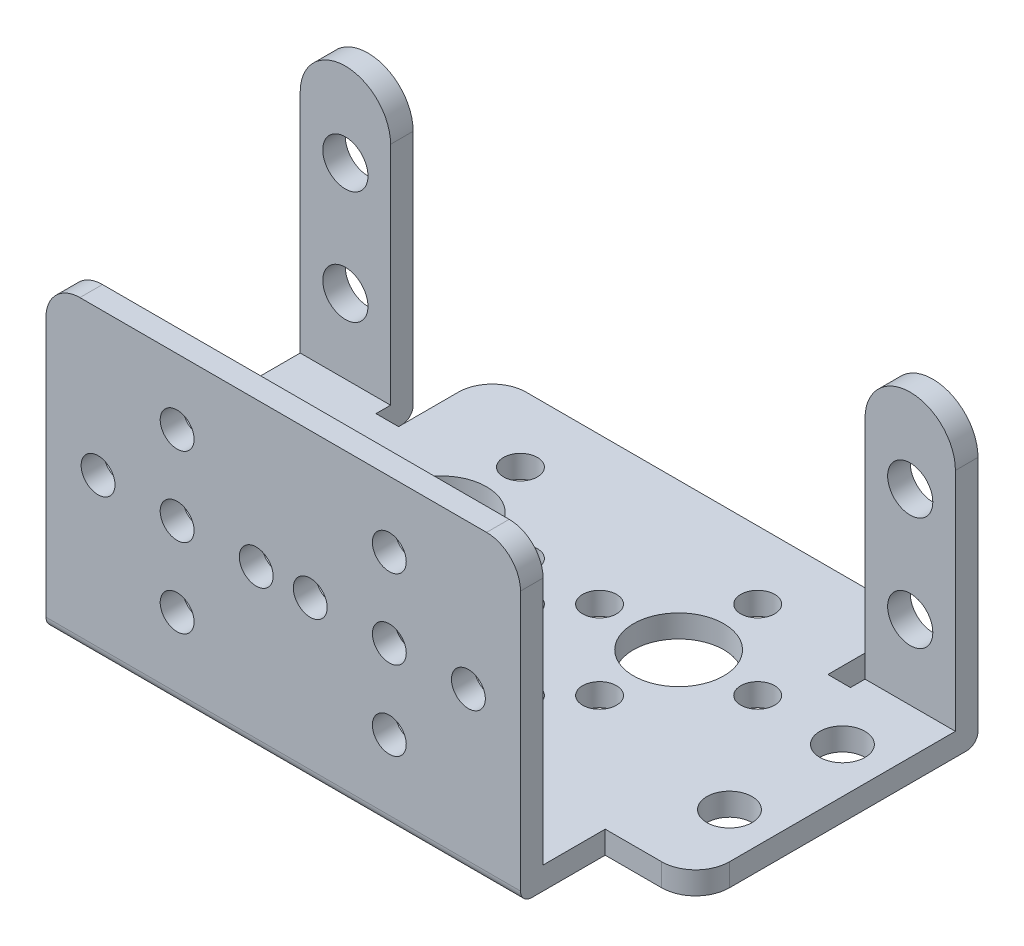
from build123d import *

# Parameters (mm, degrees)
SKETCH1_R               = 2
SKETCH1_R_2             = 4
SKETCH1_R_3             = 1.5
BOSS_EXTRUDE1_DEPTH     = 27
CUT_EXTRUDE1_DEPTH      = 55.555018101
CUT_EXTRUDE1_DEPTH_BACK = 55.555018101
SKETCH3_W               = 28.5
SKETCH3_H               = 26.527175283
SKETCH3_W_2             = 6.268481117
SKETCH4_R               = 2
SKETCH4_R_2             = 1.5
CUT_EXTRUDE2_DEPTH      = 55.555018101
SKETCH5_W               = 38
SKETCH5_H               = 27.064125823
CUT_EXTRUDE3_DEPTH      = 27
FILLET1_R               = 3
FILLET2_R               = 1


with BuildPart() as part:
    # Sketch1 → Boss-Extrude1 (new body)
    with BuildSketch(Plane(origin=(0, 0, 0), x_dir=(1, 0, 0), z_dir=(0, 1, 0))):
        with BuildLine():
            Line((21, 0), (-21, 0))
            Line((-21, 0), (-21, 7.5))
            Line((-21, 7.5), (-26, 7.5))
            ThreePointArc((-26, 7.5), (-28.121320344, 8.378679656), (-29, 10.5))
            Line((-29, 10.5), (-29, 32.5))
            Line((-29, 32.5), (-21, 32.5))
            Line((-21, 32.5), (-21, 29.209337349))
            Line((-21, 29.209337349), (-19, 29.209337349))
            Line((-19, 29.209337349), (-19, 34.5))
            ThreePointArc((-19, 34.5), (-18.121320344, 36.621320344), (-16, 37.5))
            Line((-16, 37.5), (16, 37.5))
            ThreePointArc((16, 37.5), (18.121320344, 36.621320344), (19, 34.5))
            Line((19, 34.5), (19, 29.209337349))
            Line((19, 29.209337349), (21, 29.209337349))
            Line((21, 29.209337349), (21, 32.5))
            Line((21, 32.5), (29, 32.5))
            Line((29, 32.5), (29, 10.5))
            ThreePointArc((29, 10.5), (28.121320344, 8.378679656), (26, 7.5))
            Line((26, 7.5), (21, 7.5))
            Line((21, 7.5), (21, 0))
        make_face()
        with Locations(Location((-25, 24.5, 0), (0, 0, 270))):
            Circle(SKETCH1_R, mode=Mode.SUBTRACT)
        with Locations(Location((-25, 14.5, 0), (0, 0, 270))):
            Circle(SKETCH1_R, mode=Mode.SUBTRACT)
        with Locations(Location((25, 14.5, 0), (0, 0, 90))):
            Circle(SKETCH1_R, mode=Mode.SUBTRACT)
        with Locations(Location((25, 24.5, 0), (0, 0, 90))):
            Circle(SKETCH1_R, mode=Mode.SUBTRACT)
        with Locations(Location((0, 14, 0), (0, 0, 270))):
            Circle(SKETCH1_R_2, mode=Mode.SUBTRACT)
        with Locations(Location((0, 21, 0), (0, 0, 270))):
            Circle(SKETCH1_R_3, mode=Mode.SUBTRACT)
        with Locations(Location((7, 14, 0), (0, 0, 270))):
            Circle(SKETCH1_R_3, mode=Mode.SUBTRACT)
        with Locations(Location((0, 7, 0), (0, 0, 270))):
            Circle(SKETCH1_R_3, mode=Mode.SUBTRACT)
        with Locations(Location((-7, 14, 0), (0, 0, 270))):
            Circle(SKETCH1_R_3, mode=Mode.SUBTRACT)
        with Locations(Location((10.5, 24.5, 0), (0, 0, 270))):
            Circle(SKETCH1_R_2, mode=Mode.SUBTRACT)
        with Locations(Location((10.5, 31.5, 0), (0, 0, 270))):
            Circle(SKETCH1_R_3, mode=Mode.SUBTRACT)
        with Locations(Location((-10.5, 24.5, 0), (0, 0, 270))):
            Circle(SKETCH1_R_2, mode=Mode.SUBTRACT)
        with Locations(Location((-10.5, 31.5, 0), (0, 0, 270))):
            Circle(SKETCH1_R_3, mode=Mode.SUBTRACT)
        with Locations(Location((3.5, 24.5, 0), (0, 0, 270))):
            Circle(SKETCH1_R_3, mode=Mode.SUBTRACT)
        with Locations(Location((10.5, 17.5, 0), (0, 0, 270))):
            Circle(SKETCH1_R_3, mode=Mode.SUBTRACT)
        with Locations(Location((17.5, 24.5, 0), (0, 0, 270))):
            Circle(SKETCH1_R_3, mode=Mode.SUBTRACT)
        with Locations(Location((-3.5, 24.5, 0), (0, 0, 270))):
            Circle(SKETCH1_R_3, mode=Mode.SUBTRACT)
        with Locations(Location((-10.5, 17.5, 0), (0, 0, 270))):
            Circle(SKETCH1_R_3, mode=Mode.SUBTRACT)
        with Locations(Location((-17.5, 24.5, 0), (0, 0, 270))):
            Circle(SKETCH1_R_3, mode=Mode.SUBTRACT)
    extrude(amount=BOSS_EXTRUDE1_DEPTH)

    # Sketch3 → Cut-Extrude1 (cut, two sides: drawn at the far end of the back side and taken through both)
    with BuildSketch(Plane(origin=(0, 0, 0), x_dir=(0, 0, -1), z_dir=(1, 0, 0)).offset(-CUT_EXTRUDE1_DEPTH_BACK)):
        with Locations((16.25, 15.263587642)):
            Rectangle(SKETCH3_W, SKETCH3_H)
        with Locations((35.691254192, 15.263587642)):
            Rectangle(SKETCH3_W_2, SKETCH3_H)
    extrude(amount=CUT_EXTRUDE1_DEPTH + CUT_EXTRUDE1_DEPTH_BACK, mode=Mode.SUBTRACT)

    # Sketch4 → Cut-Extrude2 (cut, through all)
    with BuildSketch(Plane.XY):
        with Locations((-25, 18.573417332)):
            Circle(SKETCH4_R)
        with Locations((-25, 8.573417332)):
            Circle(SKETCH4_R)
        with Locations((-9.391233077, 21.187393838)):
            Circle(SKETCH4_R_2)
        with Locations((-2.391233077, 14.187393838)):
            Circle(SKETCH4_R_2)
        with Locations((-9.391233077, 7.187393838)):
            Circle(SKETCH4_R_2)
        with Locations((-16.391233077, 14.187393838)):
            Circle(SKETCH4_R_2)
        with Locations((2.391233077, 14.187393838)):
            Circle(SKETCH4_R_2)
        with Locations((16.391233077, 14.187393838)):
            Circle(SKETCH4_R_2)
        with Locations(Location((9.391233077, 7.187393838, 0), (0, 0, 270))):
            Circle(SKETCH4_R_2)
        with Locations(Location((9.391233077, 21.187393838, 0), (0, 0, 270))):
            Circle(SKETCH4_R_2)
        with Locations((25, 8.573417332)):
            Circle(SKETCH4_R)
        with Locations((25, 18.573417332)):
            Circle(SKETCH4_R)
        with Locations((-9.391233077, 14.187393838)):
            Circle(SKETCH4_R_2)
        with Locations((9.391233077, 14.187393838)):
            Circle(SKETCH4_R_2)
        with BuildLine():
            Line((-29, 22), (-29, 28.587976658))
            Line((-29, 28.587976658), (-21, 28.587976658))
            Line((-21, 28.587976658), (-21, 22))
            ThreePointArc((-21, 22), (-25, 26), (-29, 22))
        make_face()
        with BuildLine():
            Line((21, 28.587976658), (21, 22))
            ThreePointArc((21, 22), (25, 26), (29, 22))
            Line((29, 22), (29, 28.587976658))
            Line((29, 28.587976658), (21, 28.587976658))
        make_face()
    extrude(amount=-CUT_EXTRUDE2_DEPTH, mode=Mode.SUBTRACT)

    # Sketch5 → Cut-Extrude3 (cut)
    with BuildSketch(Plane(origin=(0, 0, -32.557013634), x_dir=(-1, 0, 0), z_dir=(0, 0, -1))):
        with Locations((0, 15.532062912)):
            Rectangle(SKETCH5_W, SKETCH5_H)
    extrude(amount=-CUT_EXTRUDE3_DEPTH, mode=Mode.SUBTRACT)

    # Fillet1
    fillet1_edges = [part.edges().sort_by_distance(p)[0] for p in [
        (21, 27, -1),
        (-21, 27, -1),
    ]]
    fillet(fillet1_edges, radius=FILLET1_R)

    # Fillet2
    fillet2_edges = [part.edges().sort_by_distance(p)[0] for p in [
        (-25, 0, -32.5),
        (25, 0, -32.5),
        (0, 0, 0),
    ]]
    fillet(fillet2_edges, radius=FILLET2_R)


solid = part.part
